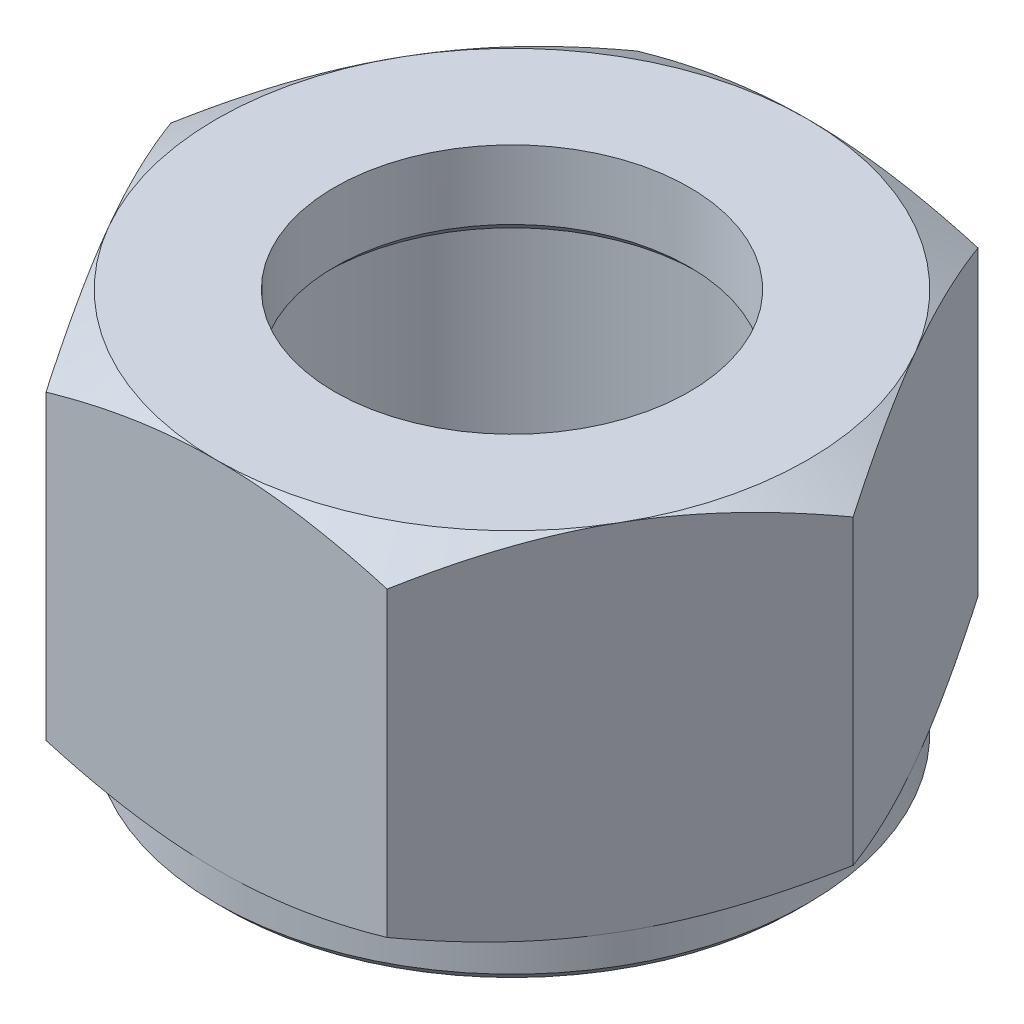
from build123d import *

# Parameters (mm, degrees)
P_IDAT_VYSUNUT_M1_DEPTH  = 18
SKICA2_OUTSIDE_W         = 108.842
SKICA2_OUTSIDE_H         = 104.2
SKICA2_OUTSIDE_R         = 15
ODEBRAT_VYSUNUT_M1_DEPTH = 18
ODEBRAT_VYSUNUT_M1_DRAFT = -60
SKICA3_OUTSIDE_W         = 108.842
SKICA3_OUTSIDE_H         = 104.2
SKICA3_OUTSIDE_R         = 15
ODEBRAT_VYSUNUT_M2_DEPTH = 18
ODEBRAT_VYSUNUT_M2_DRAFT = -60
SKICA4_R                 = 15
P_IDAT_VYSUNUT_M2_DEPTH  = 2
ZKOSEN_1_SIZE            = 0.5
SKICA5_R                 = 11
ODEBRAT_VYSUNUT_M3_DEPTH = 16
ODEBRAT_VYSUNUT_M4_REACH = 32.414
SKICA6_R                 = 9
ZKOSEN_2_SIZE            = 0.5


with BuildPart() as part:
    # Skica1 → P_idat vysunut_m1 (new body)
    with BuildSketch(Plane(origin=(0, 0, 0), x_dir=(1, 0, 0), z_dir=(0, 1, 0))):
        Polygon((17.320508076, 0), (8.660254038, 15), (-8.660254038, 15), (-17.320508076, 0), (-8.660254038, -15), (8.660254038, -15), align=None)
    extrude(amount=P_IDAT_VYSUNUT_M1_DEPTH)


with BuildPart() as odebrat_vysunut_m1_tool:
    # Skica2 outside → Odebrat vysunut_m1 (with draft: the straight prism first)
    with BuildSketch(Plane(origin=(0, 18, 0), x_dir=(-1, 0, 0), z_dir=(0, 1, 0))):
        Rectangle(SKICA2_OUTSIDE_W, SKICA2_OUTSIDE_H)
        Circle(SKICA2_OUTSIDE_R, mode=Mode.SUBTRACT)
    extrude(amount=-ODEBRAT_VYSUNUT_M1_DEPTH)
    # Odebrat vysunut_m1: the draft: its side faces are tilted about the plane it starts from
    odebrat_vysunut_m1_sides = [odebrat_vysunut_m1_tool.faces().sort_by_distance(p)[0] for p in [
        (0, 9, -52.1),
        (-54.421, 9, 0),
        (0, 9, 52.1),
        (54.421, 9, 0),
        (15, 9, 0),
    ]]
    draft(odebrat_vysunut_m1_sides, Plane(origin=(0, 18, 0), x_dir=(-1, 0, 0), z_dir=(0, 1, 0)), ODEBRAT_VYSUNUT_M1_DRAFT)


with BuildPart() as part_1:
    add(part.part)

    # Odebrat vysunut_m1: cut by odebrat_vysunut_m1_tool
    add(odebrat_vysunut_m1_tool.part, mode=Mode.SUBTRACT)


with BuildPart() as odebrat_vysunut_m2_tool:
    # Skica3 outside → Odebrat vysunut_m2 (with draft: the straight prism first)
    with BuildSketch(Plane.XZ):
        Rectangle(SKICA3_OUTSIDE_W, SKICA3_OUTSIDE_H)
        Circle(SKICA3_OUTSIDE_R, mode=Mode.SUBTRACT)
    extrude(amount=-ODEBRAT_VYSUNUT_M2_DEPTH)
    # Odebrat vysunut_m2: the draft: its side faces are tilted about the plane it starts from
    odebrat_vysunut_m2_sides = [odebrat_vysunut_m2_tool.faces().sort_by_distance(p)[0] for p in [
        (0, 9, -52.1),
        (54.421, 9, 0),
        (0, 9, 52.1),
        (-54.421, 9, 0),
        (-15, 9, 0),
    ]]
    draft(odebrat_vysunut_m2_sides, Plane.XZ, ODEBRAT_VYSUNUT_M2_DRAFT)


with BuildPart() as part_2:
    add(part_1.part)

    # Odebrat vysunut_m2: cut by odebrat_vysunut_m2_tool
    add(odebrat_vysunut_m2_tool.part, mode=Mode.SUBTRACT)

    # Skica4 → P_idat vysunut_m2 (add)
    with BuildSketch(Plane.XZ):
        with Locations(Location((0, 0, 0), (0, 0, 270))):
            Circle(SKICA4_R)
    extrude(amount=P_IDAT_VYSUNUT_M2_DEPTH)

    # Zkosen_1
    zkosen_1_edges = [part_2.edges().sort_by_distance(p)[0] for p in [
        (0, -2, 15),
    ]]
    chamfer(zkosen_1_edges, length=ZKOSEN_1_SIZE)

    # Skica5 → Odebrat vysunut_m3 (cut)
    with BuildSketch(Plane.XZ.offset(2)):
        with Locations(Location((0, 0, 0), (0, 0, 270))):
            Circle(SKICA5_R)
    extrude(amount=-ODEBRAT_VYSUNUT_M3_DEPTH, mode=Mode.SUBTRACT)

    # Skica6 → Odebrat vysunut_m4 (cut, up to next)
    with BuildSketch(Plane(origin=(0, 18, 0), x_dir=(1, 0, 0), z_dir=(0, 1, 0)), mode=Mode.PRIVATE) as odebrat_vysunut_m4_sk1:
        with Locations(Location((0, 0, 0), (0, 0, 270))):
            Circle(SKICA6_R)
    odebrat_vysunut_m4_tool1 = extrude(odebrat_vysunut_m4_sk1.sketch, amount=-ODEBRAT_VYSUNUT_M4_REACH, mode=Mode.PRIVATE) & part_2.part
    add(odebrat_vysunut_m4_tool1.solids().sort_by_distance((0, 18, 0))[0], mode=Mode.SUBTRACT)

    # Zkosen_2
    zkosen_2_edges = [part_2.edges().sort_by_distance(p)[0] for p in [
        (0, 14, -9),
    ]]
    chamfer(zkosen_2_edges, length=ZKOSEN_2_SIZE)


solid = part_2.part
